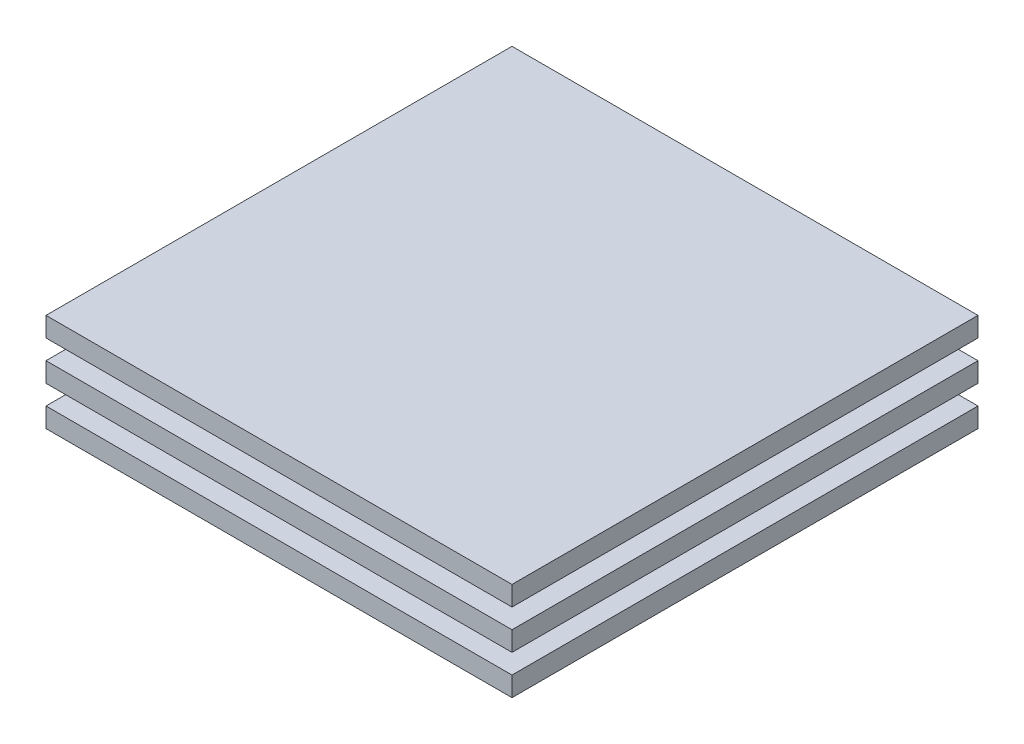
ISO-10303-21;
HEADER;
FILE_DESCRIPTION(('STEP AP214'),'2;1');
FILE_NAME('part.step','',(''),(''),'','','');
FILE_SCHEMA(('AUTOMOTIVE_DESIGN { 1 0 10303 214 1 1 1 1 }'));
ENDSEC;
DATA;
#1=APPLICATION_CONTEXT('core data for automotive mechanical design processes');
#2=APPLICATION_PROTOCOL_DEFINITION('international standard','automotive_design',2000,#1);
#3=PRODUCT_CONTEXT('',#1,'mechanical');
#4=PRODUCT('Part','Part','',(#3));
#5=PRODUCT_RELATED_PRODUCT_CATEGORY('part','',(#4));
#6=PRODUCT_DEFINITION_FORMATION('','',#4);
#7=PRODUCT_DEFINITION_CONTEXT('part definition',#1,'design');
#8=PRODUCT_DEFINITION('design','',#6,#7);
#9=PRODUCT_DEFINITION_SHAPE('','',#8);
#10=(LENGTH_UNIT() NAMED_UNIT(*) SI_UNIT(.MILLI.,.METRE.));
#11=(NAMED_UNIT(*) PLANE_ANGLE_UNIT() SI_UNIT($,.RADIAN.));
#12=(NAMED_UNIT(*) SI_UNIT($,.STERADIAN.) SOLID_ANGLE_UNIT());
#13=UNCERTAINTY_MEASURE_WITH_UNIT(LENGTH_MEASURE(1.E-05),#10,'distance_accuracy_value','');
#14=(GEOMETRIC_REPRESENTATION_CONTEXT(3) GLOBAL_UNCERTAINTY_ASSIGNED_CONTEXT((#13)) GLOBAL_UNIT_ASSIGNED_CONTEXT((#10,
#11,#12)) REPRESENTATION_CONTEXT('',''));
#15=CARTESIAN_POINT('',(0.,0.,0.));
#16=DIRECTION('',(0.,0.,1.));
#17=DIRECTION('',(1.,0.,0.));
#18=AXIS2_PLACEMENT_3D('',#15,#16,#17);
#19=CARTESIAN_POINT('',(4.82599999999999,0.4064,-4.826));
#20=DIRECTION('',(-1.,0.,0.));
#21=DIRECTION('',(0.,0.,1.));
#22=AXIS2_PLACEMENT_3D('',#19,#20,#21);
#23=PLANE('',#22);
#24=DIRECTION('',(0.,0.,-1.));
#25=VECTOR('',#24,1.);
#26=CARTESIAN_POINT('',(4.82599999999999,0.,-4.826));
#27=LINE('',#26,#25);
#28=CARTESIAN_POINT('',(4.82599999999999,0.,4.826));
#29=VERTEX_POINT('',#28);
#30=CARTESIAN_POINT('',(4.82599999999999,0.,-4.826));
#31=VERTEX_POINT('',#30);
#32=EDGE_CURVE('E201',#29,#31,#27,.T.);
#33=ORIENTED_EDGE('',*,*,#32,.T.);
#34=DIRECTION('',(0.,-1.,0.));
#35=VECTOR('',#34,1.);
#36=CARTESIAN_POINT('',(4.82599999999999,0.4064,-4.826));
#37=LINE('',#36,#35);
#38=CARTESIAN_POINT('',(4.82599999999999,0.4064,-4.826));
#39=VERTEX_POINT('',#38);
#40=EDGE_CURVE('E37',#39,#31,#37,.T.);
#41=ORIENTED_EDGE('',*,*,#40,.F.);
#42=DIRECTION('',(0.,0.,-1.));
#43=VECTOR('',#42,1.);
#44=CARTESIAN_POINT('',(4.82599999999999,0.4064,-4.826));
#45=LINE('',#44,#43);
#46=CARTESIAN_POINT('',(4.82599999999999,0.4064,4.826));
#47=VERTEX_POINT('',#46);
#48=EDGE_CURVE('E204',#47,#39,#45,.T.);
#49=ORIENTED_EDGE('',*,*,#48,.F.);
#50=DIRECTION('',(0.,-1.,0.));
#51=VECTOR('',#50,1.);
#52=CARTESIAN_POINT('',(4.82599999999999,0.4064,4.826));
#53=LINE('',#52,#51);
#54=EDGE_CURVE('E210',#47,#29,#53,.T.);
#55=ORIENTED_EDGE('',*,*,#54,.T.);
#56=EDGE_LOOP('',(#33,#41,#49,#55));
#57=FACE_BOUND('',#56,.T.);
#58=ADVANCED_FACE('F34',(#57),#23,.F.);
#59=CARTESIAN_POINT('',(-4.82599999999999,0.4064,-4.826));
#60=DIRECTION('',(0.,0.,1.));
#61=DIRECTION('',(1.,0.,0.));
#62=AXIS2_PLACEMENT_3D('',#59,#60,#61);
#63=PLANE('',#62);
#64=DIRECTION('',(-1.,0.,0.));
#65=VECTOR('',#64,1.);
#66=CARTESIAN_POINT('',(-4.82599999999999,0.,-4.826));
#67=LINE('',#66,#65);
#68=CARTESIAN_POINT('',(-4.82599999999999,0.,-4.826));
#69=VERTEX_POINT('',#68);
#70=EDGE_CURVE('E213',#31,#69,#67,.T.);
#71=ORIENTED_EDGE('',*,*,#70,.T.);
#72=DIRECTION('',(0.,-1.,0.));
#73=VECTOR('',#72,1.);
#74=CARTESIAN_POINT('',(-4.82599999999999,0.4064,-4.826));
#75=LINE('',#74,#73);
#76=CARTESIAN_POINT('',(-4.82599999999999,0.4064,-4.826));
#77=VERTEX_POINT('',#76);
#78=EDGE_CURVE('E219',#77,#69,#75,.T.);
#79=ORIENTED_EDGE('',*,*,#78,.F.);
#80=DIRECTION('',(-1.,0.,0.));
#81=VECTOR('',#80,1.);
#82=CARTESIAN_POINT('',(-4.82599999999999,0.4064,-4.826));
#83=LINE('',#82,#81);
#84=EDGE_CURVE('E84',#39,#77,#83,.T.);
#85=ORIENTED_EDGE('',*,*,#84,.F.);
#86=ORIENTED_EDGE('',*,*,#40,.T.);
#87=EDGE_LOOP('',(#71,#79,#85,#86));
#88=FACE_BOUND('',#87,.T.);
#89=ADVANCED_FACE('F222',(#88),#63,.F.);
#90=CARTESIAN_POINT('',(-4.82599999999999,0.4064,-4.826));
#91=DIRECTION('',(1.,0.,0.));
#92=DIRECTION('',(0.,0.,-1.));
#93=AXIS2_PLACEMENT_3D('',#90,#91,#92);
#94=PLANE('',#93);
#95=DIRECTION('',(0.,0.,1.));
#96=VECTOR('',#95,1.);
#97=CARTESIAN_POINT('',(-4.82599999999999,0.,-4.826));
#98=LINE('',#97,#96);
#99=CARTESIAN_POINT('',(-4.82599999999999,0.,4.826));
#100=VERTEX_POINT('',#99);
#101=EDGE_CURVE('E70',#69,#100,#98,.T.);
#102=ORIENTED_EDGE('',*,*,#101,.T.);
#103=DIRECTION('',(0.,-1.,0.));
#104=VECTOR('',#103,1.);
#105=CARTESIAN_POINT('',(-4.82599999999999,0.4064,4.826));
#106=LINE('',#105,#104);
#107=CARTESIAN_POINT('',(-4.82599999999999,0.4064,4.826));
#108=VERTEX_POINT('',#107);
#109=EDGE_CURVE('E218',#108,#100,#106,.T.);
#110=ORIENTED_EDGE('',*,*,#109,.F.);
#111=DIRECTION('',(0.,0.,1.));
#112=VECTOR('',#111,1.);
#113=CARTESIAN_POINT('',(-4.82599999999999,0.4064,-4.826));
#114=LINE('',#113,#112);
#115=EDGE_CURVE('E207',#77,#108,#114,.T.);
#116=ORIENTED_EDGE('',*,*,#115,.F.);
#117=ORIENTED_EDGE('',*,*,#78,.T.);
#118=EDGE_LOOP('',(#102,#110,#116,#117));
#119=FACE_BOUND('',#118,.T.);
#120=ADVANCED_FACE('F247',(#119),#94,.F.);
#121=CARTESIAN_POINT('',(-4.82599999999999,0.4064,4.826));
#122=DIRECTION('',(0.,0.,-1.));
#123=DIRECTION('',(-1.,0.,0.));
#124=AXIS2_PLACEMENT_3D('',#121,#122,#123);
#125=PLANE('',#124);
#126=DIRECTION('',(1.,0.,0.));
#127=VECTOR('',#126,1.);
#128=CARTESIAN_POINT('',(-4.82599999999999,0.,4.826));
#129=LINE('',#128,#127);
#130=EDGE_CURVE('E76',#100,#29,#129,.T.);
#131=ORIENTED_EDGE('',*,*,#130,.T.);
#132=ORIENTED_EDGE('',*,*,#54,.F.);
#133=DIRECTION('',(1.,0.,0.));
#134=VECTOR('',#133,1.);
#135=CARTESIAN_POINT('',(-4.82599999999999,0.4064,4.826));
#136=LINE('',#135,#134);
#137=EDGE_CURVE('E52',#108,#47,#136,.T.);
#138=ORIENTED_EDGE('',*,*,#137,.F.);
#139=ORIENTED_EDGE('',*,*,#109,.T.);
#140=EDGE_LOOP('',(#131,#132,#138,#139));
#141=FACE_BOUND('',#140,.T.);
#142=ADVANCED_FACE('F239',(#141),#125,.F.);
#143=CARTESIAN_POINT('',(0.,0.4064,0.));
#144=DIRECTION('',(0.,1.,0.));
#145=DIRECTION('',(0.,0.,1.));
#146=AXIS2_PLACEMENT_3D('',#143,#144,#145);
#147=PLANE('',#146);
#148=CARTESIAN_POINT('',(0.,0.4064,0.));
#149=DIRECTION('',(0.,1.,0.));
#150=DIRECTION('',(0.,0.,1.));
#151=AXIS2_PLACEMENT_3D('',#148,#149,#150);
#152=CIRCLE('',#151,4.064);
#153=CARTESIAN_POINT('',(0.,0.4064,4.064));
#154=VERTEX_POINT('',#153);
#155=EDGE_CURVE('E43',#154,#154,#152,.T.);
#156=ORIENTED_EDGE('',*,*,#155,.F.);
#157=EDGE_LOOP('',(#156));
#158=FACE_BOUND('',#157,.T.);
#159=ORIENTED_EDGE('',*,*,#48,.T.);
#160=ORIENTED_EDGE('',*,*,#84,.T.);
#161=ORIENTED_EDGE('',*,*,#115,.T.);
#162=ORIENTED_EDGE('',*,*,#137,.T.);
#163=EDGE_LOOP('',(#159,#160,#161,#162));
#164=FACE_BOUND('',#163,.T.);
#165=ADVANCED_FACE('F230',(#158,#164),#147,.T.);
#166=CARTESIAN_POINT('',(0.,0.,0.));
#167=DIRECTION('',(0.,1.,0.));
#168=DIRECTION('',(0.,0.,1.));
#169=AXIS2_PLACEMENT_3D('',#166,#167,#168);
#170=PLANE('',#169);
#171=ORIENTED_EDGE('',*,*,#32,.F.);
#172=ORIENTED_EDGE('',*,*,#130,.F.);
#173=ORIENTED_EDGE('',*,*,#101,.F.);
#174=ORIENTED_EDGE('',*,*,#70,.F.);
#175=EDGE_LOOP('',(#171,#172,#173,#174));
#176=FACE_BOUND('',#175,.T.);
#177=ADVANCED_FACE('F227',(#176),#170,.F.);
#178=CARTESIAN_POINT('',(0.,0.8128,0.));
#179=DIRECTION('',(0.,-1.,0.));
#180=DIRECTION('',(0.,0.,-1.));
#181=AXIS2_PLACEMENT_3D('',#178,#179,#180);
#182=CYLINDRICAL_SURFACE('',#181,4.064);
#183=CARTESIAN_POINT('',(0.,0.8128,0.));
#184=DIRECTION('',(0.,1.,0.));
#185=DIRECTION('',(0.,0.,1.));
#186=AXIS2_PLACEMENT_3D('',#183,#184,#185);
#187=CIRCLE('',#186,4.064);
#188=CARTESIAN_POINT('',(0.,0.8128,4.064));
#189=VERTEX_POINT('',#188);
#190=EDGE_CURVE('E198',#189,#189,#187,.T.);
#191=ORIENTED_EDGE('',*,*,#190,.F.);
#192=EDGE_LOOP('',(#191));
#193=FACE_BOUND('',#192,.T.);
#194=ORIENTED_EDGE('',*,*,#155,.T.);
#195=EDGE_LOOP('',(#194));
#196=FACE_BOUND('',#195,.T.);
#197=ADVANCED_FACE('F229',(#193,#196),#182,.T.);
#198=CARTESIAN_POINT('',(4.82599999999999,1.2192,4.826));
#199=DIRECTION('',(-1.,0.,0.));
#200=DIRECTION('',(0.,0.,1.));
#201=AXIS2_PLACEMENT_3D('',#198,#199,#200);
#202=PLANE('',#201);
#203=DIRECTION('',(0.,0.,-1.));
#204=VECTOR('',#203,1.);
#205=CARTESIAN_POINT('',(4.82599999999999,0.8128,4.826));
#206=LINE('',#205,#204);
#207=CARTESIAN_POINT('',(4.82599999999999,0.8128,4.826));
#208=VERTEX_POINT('',#207);
#209=CARTESIAN_POINT('',(4.82599999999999,0.8128,-4.826));
#210=VERTEX_POINT('',#209);
#211=EDGE_CURVE('E163',#208,#210,#206,.T.);
#212=ORIENTED_EDGE('',*,*,#211,.T.);
#213=DIRECTION('',(0.,-1.,0.));
#214=VECTOR('',#213,1.);
#215=CARTESIAN_POINT('',(4.82599999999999,1.2192,-4.826));
#216=LINE('',#215,#214);
#217=CARTESIAN_POINT('',(4.82599999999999,1.2192,-4.826));
#218=VERTEX_POINT('',#217);
#219=EDGE_CURVE('E195',#218,#210,#216,.T.);
#220=ORIENTED_EDGE('',*,*,#219,.F.);
#221=DIRECTION('',(0.,0.,-1.));
#222=VECTOR('',#221,1.);
#223=CARTESIAN_POINT('',(4.82599999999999,1.2192,4.826));
#224=LINE('',#223,#222);
#225=CARTESIAN_POINT('',(4.82599999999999,1.2192,4.826));
#226=VERTEX_POINT('',#225);
#227=EDGE_CURVE('E169',#226,#218,#224,.T.);
#228=ORIENTED_EDGE('',*,*,#227,.F.);
#229=DIRECTION('',(0.,-1.,0.));
#230=VECTOR('',#229,1.);
#231=CARTESIAN_POINT('',(4.82599999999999,1.2192,4.826));
#232=LINE('',#231,#230);
#233=EDGE_CURVE('E179',#226,#208,#232,.T.);
#234=ORIENTED_EDGE('',*,*,#233,.T.);
#235=EDGE_LOOP('',(#212,#220,#228,#234));
#236=FACE_BOUND('',#235,.T.);
#237=ADVANCED_FACE('F236',(#236),#202,.F.);
#238=CARTESIAN_POINT('',(-4.82599999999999,1.2192,-4.826));
#239=DIRECTION('',(0.,0.,1.));
#240=DIRECTION('',(1.,0.,0.));
#241=AXIS2_PLACEMENT_3D('',#238,#239,#240);
#242=PLANE('',#241);
#243=DIRECTION('',(-1.,0.,0.));
#244=VECTOR('',#243,1.);
#245=CARTESIAN_POINT('',(-4.82599999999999,0.8128,-4.826));
#246=LINE('',#245,#244);
#247=CARTESIAN_POINT('',(-4.82599999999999,0.8128,-4.826));
#248=VERTEX_POINT('',#247);
#249=EDGE_CURVE('E182',#210,#248,#246,.T.);
#250=ORIENTED_EDGE('',*,*,#249,.T.);
#251=DIRECTION('',(0.,-1.,0.));
#252=VECTOR('',#251,1.);
#253=CARTESIAN_POINT('',(-4.82599999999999,1.2192,-4.826));
#254=LINE('',#253,#252);
#255=CARTESIAN_POINT('',(-4.82599999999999,1.2192,-4.826));
#256=VERTEX_POINT('',#255);
#257=EDGE_CURVE('E192',#256,#248,#254,.T.);
#258=ORIENTED_EDGE('',*,*,#257,.F.);
#259=DIRECTION('',(-1.,0.,0.));
#260=VECTOR('',#259,1.);
#261=CARTESIAN_POINT('',(-4.82599999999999,1.2192,-4.826));
#262=LINE('',#261,#260);
#263=EDGE_CURVE('E172',#218,#256,#262,.T.);
#264=ORIENTED_EDGE('',*,*,#263,.F.);
#265=ORIENTED_EDGE('',*,*,#219,.T.);
#266=EDGE_LOOP('',(#250,#258,#264,#265));
#267=FACE_BOUND('',#266,.T.);
#268=ADVANCED_FACE('F278',(#267),#242,.F.);
#269=CARTESIAN_POINT('',(-4.82599999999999,1.2192,4.826));
#270=DIRECTION('',(1.,0.,0.));
#271=DIRECTION('',(0.,0.,-1.));
#272=AXIS2_PLACEMENT_3D('',#269,#270,#271);
#273=PLANE('',#272);
#274=DIRECTION('',(0.,0.,1.));
#275=VECTOR('',#274,1.);
#276=CARTESIAN_POINT('',(-4.82599999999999,0.8128,4.826));
#277=LINE('',#276,#275);
#278=CARTESIAN_POINT('',(-4.82599999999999,0.8128,4.826));
#279=VERTEX_POINT('',#278);
#280=EDGE_CURVE('E184',#248,#279,#277,.T.);
#281=ORIENTED_EDGE('',*,*,#280,.T.);
#282=DIRECTION('',(0.,-1.,0.));
#283=VECTOR('',#282,1.);
#284=CARTESIAN_POINT('',(-4.82599999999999,1.2192,4.826));
#285=LINE('',#284,#283);
#286=CARTESIAN_POINT('',(-4.82599999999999,1.2192,4.826));
#287=VERTEX_POINT('',#286);
#288=EDGE_CURVE('E189',#287,#279,#285,.T.);
#289=ORIENTED_EDGE('',*,*,#288,.F.);
#290=DIRECTION('',(0.,0.,1.));
#291=VECTOR('',#290,1.);
#292=CARTESIAN_POINT('',(-4.82599999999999,1.2192,4.826));
#293=LINE('',#292,#291);
#294=EDGE_CURVE('E175',#256,#287,#293,.T.);
#295=ORIENTED_EDGE('',*,*,#294,.F.);
#296=ORIENTED_EDGE('',*,*,#257,.T.);
#297=EDGE_LOOP('',(#281,#289,#295,#296));
#298=FACE_BOUND('',#297,.T.);
#299=ADVANCED_FACE('F288',(#298),#273,.F.);
#300=CARTESIAN_POINT('',(-4.82599999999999,1.2192,4.826));
#301=DIRECTION('',(0.,0.,-1.));
#302=DIRECTION('',(-1.,0.,0.));
#303=AXIS2_PLACEMENT_3D('',#300,#301,#302);
#304=PLANE('',#303);
#305=DIRECTION('',(1.,0.,0.));
#306=VECTOR('',#305,1.);
#307=CARTESIAN_POINT('',(-4.82599999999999,0.8128,4.826));
#308=LINE('',#307,#306);
#309=EDGE_CURVE('E173',#279,#208,#308,.T.);
#310=ORIENTED_EDGE('',*,*,#309,.T.);
#311=ORIENTED_EDGE('',*,*,#233,.F.);
#312=DIRECTION('',(1.,0.,0.));
#313=VECTOR('',#312,1.);
#314=CARTESIAN_POINT('',(-4.82599999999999,1.2192,4.826));
#315=LINE('',#314,#313);
#316=EDGE_CURVE('E177',#287,#226,#315,.T.);
#317=ORIENTED_EDGE('',*,*,#316,.F.);
#318=ORIENTED_EDGE('',*,*,#288,.T.);
#319=EDGE_LOOP('',(#310,#311,#317,#318));
#320=FACE_BOUND('',#319,.T.);
#321=ADVANCED_FACE('F298',(#320),#304,.F.);
#322=CARTESIAN_POINT('',(0.,1.2192,0.));
#323=DIRECTION('',(0.,-1.,0.));
#324=DIRECTION('',(0.,0.,-1.));
#325=AXIS2_PLACEMENT_3D('',#322,#323,#324);
#326=PLANE('',#325);
#327=CARTESIAN_POINT('',(0.,1.2192,0.));
#328=DIRECTION('',(0.,1.,0.));
#329=DIRECTION('',(0.,0.,1.));
#330=AXIS2_PLACEMENT_3D('',#327,#328,#329);
#331=CIRCLE('',#330,4.064);
#332=CARTESIAN_POINT('',(0.,1.2192,4.064));
#333=VERTEX_POINT('',#332);
#334=EDGE_CURVE('E11',#333,#333,#331,.T.);
#335=ORIENTED_EDGE('',*,*,#334,.F.);
#336=EDGE_LOOP('',(#335));
#337=FACE_BOUND('',#336,.T.);
#338=ORIENTED_EDGE('',*,*,#227,.T.);
#339=ORIENTED_EDGE('',*,*,#263,.T.);
#340=ORIENTED_EDGE('',*,*,#294,.T.);
#341=ORIENTED_EDGE('',*,*,#316,.T.);
#342=EDGE_LOOP('',(#338,#339,#340,#341));
#343=FACE_BOUND('',#342,.T.);
#344=ADVANCED_FACE('F308',(#337,#343),#326,.F.);
#345=CARTESIAN_POINT('',(0.,0.8128,0.));
#346=DIRECTION('',(0.,-1.,0.));
#347=DIRECTION('',(0.,0.,-1.));
#348=AXIS2_PLACEMENT_3D('',#345,#346,#347);
#349=PLANE('',#348);
#350=ORIENTED_EDGE('',*,*,#190,.T.);
#351=EDGE_LOOP('',(#350));
#352=FACE_BOUND('',#351,.T.);
#353=ORIENTED_EDGE('',*,*,#211,.F.);
#354=ORIENTED_EDGE('',*,*,#309,.F.);
#355=ORIENTED_EDGE('',*,*,#280,.F.);
#356=ORIENTED_EDGE('',*,*,#249,.F.);
#357=EDGE_LOOP('',(#353,#354,#355,#356));
#358=FACE_BOUND('',#357,.T.);
#359=ADVANCED_FACE('F316',(#352,#358),#349,.T.);
#360=CARTESIAN_POINT('',(0.,1.6256,0.));
#361=DIRECTION('',(0.,-1.,0.));
#362=DIRECTION('',(0.,0.,-1.));
#363=AXIS2_PLACEMENT_3D('',#360,#361,#362);
#364=CYLINDRICAL_SURFACE('',#363,4.064);
#365=CARTESIAN_POINT('',(0.,1.6256,0.));
#366=DIRECTION('',(0.,1.,0.));
#367=DIRECTION('',(0.,0.,1.));
#368=AXIS2_PLACEMENT_3D('',#365,#366,#367);
#369=CIRCLE('',#368,4.064);
#370=CARTESIAN_POINT('',(0.,1.6256,4.064));
#371=VERTEX_POINT('',#370);
#372=EDGE_CURVE('E160',#371,#371,#369,.T.);
#373=ORIENTED_EDGE('',*,*,#372,.F.);
#374=EDGE_LOOP('',(#373));
#375=FACE_BOUND('',#374,.T.);
#376=ORIENTED_EDGE('',*,*,#334,.T.);
#377=EDGE_LOOP('',(#376));
#378=FACE_BOUND('',#377,.T.);
#379=ADVANCED_FACE('F321',(#375,#378),#364,.T.);
#380=CARTESIAN_POINT('',(4.82599999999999,2.032,4.826));
#381=DIRECTION('',(-1.,0.,0.));
#382=DIRECTION('',(0.,0.,1.));
#383=AXIS2_PLACEMENT_3D('',#380,#381,#382);
#384=PLANE('',#383);
#385=DIRECTION('',(0.,0.,-1.));
#386=VECTOR('',#385,1.);
#387=CARTESIAN_POINT('',(4.82599999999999,1.6256,4.826));
#388=LINE('',#387,#386);
#389=CARTESIAN_POINT('',(4.82599999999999,1.6256,4.826));
#390=VERTEX_POINT('',#389);
#391=CARTESIAN_POINT('',(4.82599999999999,1.6256,-4.826));
#392=VERTEX_POINT('',#391);
#393=EDGE_CURVE('E159',#390,#392,#388,.T.);
#394=ORIENTED_EDGE('',*,*,#393,.T.);
#395=DIRECTION('',(0.,-1.,0.));
#396=VECTOR('',#395,1.);
#397=CARTESIAN_POINT('',(4.82599999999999,2.032,-4.826));
#398=LINE('',#397,#396);
#399=CARTESIAN_POINT('',(4.82599999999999,2.032,-4.826));
#400=VERTEX_POINT('',#399);
#401=EDGE_CURVE('E139',#400,#392,#398,.T.);
#402=ORIENTED_EDGE('',*,*,#401,.F.);
#403=DIRECTION('',(0.,0.,-1.));
#404=VECTOR('',#403,1.);
#405=CARTESIAN_POINT('',(4.82599999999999,2.032,4.826));
#406=LINE('',#405,#404);
#407=CARTESIAN_POINT('',(4.82599999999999,2.032,4.826));
#408=VERTEX_POINT('',#407);
#409=EDGE_CURVE('E146',#408,#400,#406,.T.);
#410=ORIENTED_EDGE('',*,*,#409,.F.);
#411=DIRECTION('',(0.,-1.,0.));
#412=VECTOR('',#411,1.);
#413=CARTESIAN_POINT('',(4.82599999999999,2.032,4.826));
#414=LINE('',#413,#412);
#415=EDGE_CURVE('E409',#408,#390,#414,.T.);
#416=ORIENTED_EDGE('',*,*,#415,.T.);
#417=EDGE_LOOP('',(#394,#402,#410,#416));
#418=FACE_BOUND('',#417,.T.);
#419=ADVANCED_FACE('F157',(#418),#384,.F.);
#420=CARTESIAN_POINT('',(-4.82599999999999,2.032,-4.826));
#421=DIRECTION('',(0.,0.,1.));
#422=DIRECTION('',(1.,0.,0.));
#423=AXIS2_PLACEMENT_3D('',#420,#421,#422);
#424=PLANE('',#423);
#425=DIRECTION('',(-1.,0.,0.));
#426=VECTOR('',#425,1.);
#427=CARTESIAN_POINT('',(-4.82599999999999,1.6256,-4.826));
#428=LINE('',#427,#426);
#429=CARTESIAN_POINT('',(-4.82599999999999,1.6256,-4.826));
#430=VERTEX_POINT('',#429);
#431=EDGE_CURVE('E400',#392,#430,#428,.T.);
#432=ORIENTED_EDGE('',*,*,#431,.T.);
#433=DIRECTION('',(0.,-1.,0.));
#434=VECTOR('',#433,1.);
#435=CARTESIAN_POINT('',(-4.82599999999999,2.032,-4.826));
#436=LINE('',#435,#434);
#437=CARTESIAN_POINT('',(-4.82599999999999,2.032,-4.826));
#438=VERTEX_POINT('',#437);
#439=EDGE_CURVE('E142',#438,#430,#436,.T.);
#440=ORIENTED_EDGE('',*,*,#439,.F.);
#441=DIRECTION('',(-1.,0.,0.));
#442=VECTOR('',#441,1.);
#443=CARTESIAN_POINT('',(-4.82599999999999,2.032,-4.826));
#444=LINE('',#443,#442);
#445=EDGE_CURVE('E135',#400,#438,#444,.T.);
#446=ORIENTED_EDGE('',*,*,#445,.F.);
#447=ORIENTED_EDGE('',*,*,#401,.T.);
#448=EDGE_LOOP('',(#432,#440,#446,#447));
#449=FACE_BOUND('',#448,.T.);
#450=ADVANCED_FACE('F137',(#449),#424,.F.);
#451=CARTESIAN_POINT('',(-4.82599999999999,2.032,4.826));
#452=DIRECTION('',(1.,0.,0.));
#453=DIRECTION('',(0.,0.,-1.));
#454=AXIS2_PLACEMENT_3D('',#451,#452,#453);
#455=PLANE('',#454);
#456=DIRECTION('',(0.,0.,1.));
#457=VECTOR('',#456,1.);
#458=CARTESIAN_POINT('',(-4.82599999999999,1.6256,4.826));
#459=LINE('',#458,#457);
#460=CARTESIAN_POINT('',(-4.82599999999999,1.6256,4.826));
#461=VERTEX_POINT('',#460);
#462=EDGE_CURVE('E402',#430,#461,#459,.T.);
#463=ORIENTED_EDGE('',*,*,#462,.T.);
#464=DIRECTION('',(0.,-1.,0.));
#465=VECTOR('',#464,1.);
#466=CARTESIAN_POINT('',(-4.82599999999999,2.032,4.826));
#467=LINE('',#466,#465);
#468=CARTESIAN_POINT('',(-4.82599999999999,2.032,4.826));
#469=VERTEX_POINT('',#468);
#470=EDGE_CURVE('E165',#469,#461,#467,.T.);
#471=ORIENTED_EDGE('',*,*,#470,.F.);
#472=DIRECTION('',(0.,0.,1.));
#473=VECTOR('',#472,1.);
#474=CARTESIAN_POINT('',(-4.82599999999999,2.032,4.826));
#475=LINE('',#474,#473);
#476=EDGE_CURVE('E145',#438,#469,#475,.T.);
#477=ORIENTED_EDGE('',*,*,#476,.F.);
#478=ORIENTED_EDGE('',*,*,#439,.T.);
#479=EDGE_LOOP('',(#463,#471,#477,#478));
#480=FACE_BOUND('',#479,.T.);
#481=ADVANCED_FACE('F355',(#480),#455,.F.);
#482=CARTESIAN_POINT('',(-4.82599999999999,2.032,4.826));
#483=DIRECTION('',(0.,0.,-1.));
#484=DIRECTION('',(-1.,0.,0.));
#485=AXIS2_PLACEMENT_3D('',#482,#483,#484);
#486=PLANE('',#485);
#487=DIRECTION('',(1.,0.,0.));
#488=VECTOR('',#487,1.);
#489=CARTESIAN_POINT('',(-4.82599999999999,1.6256,4.826));
#490=LINE('',#489,#488);
#491=EDGE_CURVE('E155',#461,#390,#490,.T.);
#492=ORIENTED_EDGE('',*,*,#491,.T.);
#493=ORIENTED_EDGE('',*,*,#415,.F.);
#494=DIRECTION('',(1.,0.,0.));
#495=VECTOR('',#494,1.);
#496=CARTESIAN_POINT('',(-4.82599999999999,2.032,4.826));
#497=LINE('',#496,#495);
#498=EDGE_CURVE('E151',#469,#408,#497,.T.);
#499=ORIENTED_EDGE('',*,*,#498,.F.);
#500=ORIENTED_EDGE('',*,*,#470,.T.);
#501=EDGE_LOOP('',(#492,#493,#499,#500));
#502=FACE_BOUND('',#501,.T.);
#503=ADVANCED_FACE('F364',(#502),#486,.F.);
#504=CARTESIAN_POINT('',(0.,2.032,0.));
#505=DIRECTION('',(0.,-1.,0.));
#506=DIRECTION('',(0.,0.,-1.));
#507=AXIS2_PLACEMENT_3D('',#504,#505,#506);
#508=PLANE('',#507);
#509=ORIENTED_EDGE('',*,*,#409,.T.);
#510=ORIENTED_EDGE('',*,*,#445,.T.);
#511=ORIENTED_EDGE('',*,*,#476,.T.);
#512=ORIENTED_EDGE('',*,*,#498,.T.);
#513=EDGE_LOOP('',(#509,#510,#511,#512));
#514=FACE_BOUND('',#513,.T.);
#515=ADVANCED_FACE('F149',(#514),#508,.F.);
#516=CARTESIAN_POINT('',(0.,1.6256,0.));
#517=DIRECTION('',(0.,-1.,0.));
#518=DIRECTION('',(0.,0.,-1.));
#519=AXIS2_PLACEMENT_3D('',#516,#517,#518);
#520=PLANE('',#519);
#521=ORIENTED_EDGE('',*,*,#372,.T.);
#522=EDGE_LOOP('',(#521));
#523=FACE_BOUND('',#522,.T.);
#524=ORIENTED_EDGE('',*,*,#393,.F.);
#525=ORIENTED_EDGE('',*,*,#491,.F.);
#526=ORIENTED_EDGE('',*,*,#462,.F.);
#527=ORIENTED_EDGE('',*,*,#431,.F.);
#528=EDGE_LOOP('',(#524,#525,#526,#527));
#529=FACE_BOUND('',#528,.T.);
#530=ADVANCED_FACE('F383',(#523,#529),#520,.T.);
#531=CLOSED_SHELL('',(#58,#89,#120,#142,#165,#177,#197,#237,#268,#299,#321,#344,#359,#379,#419,
#450,#481,#503,#515,#530));
#532=MANIFOLD_SOLID_BREP('B2',#531);
#533=ADVANCED_BREP_SHAPE_REPRESENTATION('',(#18,#532),#14);
#534=SHAPE_DEFINITION_REPRESENTATION(#9,#533);
ENDSEC;
END-ISO-10303-21;
